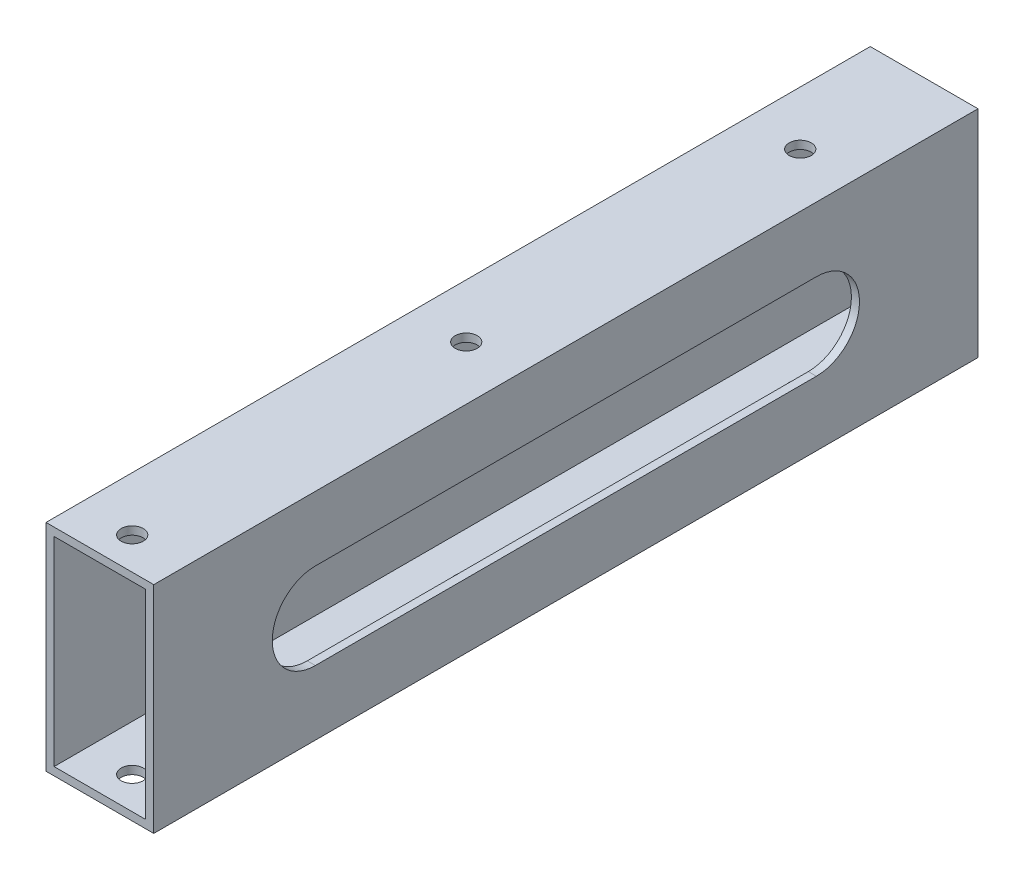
from build123d import *

# Parameters (mm, degrees)
SKETCH_1_W          = 20
SKETCH_1_H          = 40
SKETCH_1_W_2        = 17
SKETCH_1_H_2        = 37
EXTRUDE_1_DEPTH     = 170
SKETCH_2_R          = 2.05
CUT_EXTRUDE_1_DEPTH = 220
CUT_EXTRUDE_2_REACH = 174.337
SKETCH_3_W          = 17
SKETCH_3_H          = 40
CUT_EXTRUDE_3_DEPTH = 59


with BuildPart() as part:
    # Sketch 1 → Extrude 1 (new body)
    with BuildSketch(Plane.XY):
        Rectangle(SKETCH_1_W, SKETCH_1_H)
        Rectangle(SKETCH_1_W_2, SKETCH_1_H_2, mode=Mode.SUBTRACT)
    extrude(amount=EXTRUDE_1_DEPTH)

    # Sketch 2 → Cut-Extrude 1 (cut)
    with BuildSketch(Plane(origin=(0, 20, 0), x_dir=(1, 0, 0), z_dir=(0, 1, 0))):
        with Locations(Location((0, -147, 0), (0, 0, 270))):
            Circle(SKETCH_2_R)
        with Locations(Location((0, -23, 0), (0, 0, 270))):
            Circle(SKETCH_2_R)
        with Locations(Location((0, -85, 0), (0, 0, 270))):
            Circle(SKETCH_2_R)
    extrude(amount=-CUT_EXTRUDE_1_DEPTH, mode=Mode.SUBTRACT)

    # Cut-Extrude 2: up to this face of the body (flat: up to its plane)
    cut_extrude_2_end = Plane(part.part.faces().sort_by_distance((10, 0, 85))[0])
    # Sketch 3 → Cut-Extrude 2 (cut, up to the picked face)
    with BuildSketch(Plane.ZY.offset(10), mode=Mode.PRIVATE) as cut_extrude_2_sk1:
        with Locations((161.5, 0)):
            Rectangle(SKETCH_3_W, SKETCH_3_H)
    cut_extrude_2_tool1 = split(extrude(cut_extrude_2_sk1.sketch, amount=-CUT_EXTRUDE_2_REACH, mode=Mode.PRIVATE), bisect_by=cut_extrude_2_end, keep=Keep.BOTH, mode=Mode.PRIVATE)
    add(cut_extrude_2_tool1.solids().sort_by(Axis((-10, 0, 161.5), (1, 0, 0)))[0], mode=Mode.SUBTRACT)

    # Sketch 4 → Cut-Extrude 3 (cut)
    with BuildSketch(Plane(origin=(10, 0, 0), x_dir=(0, 0, -1), z_dir=(1, 0, 0))):
        with BuildLine():
            Line((-123, 8), (-30, 8))
            ThreePointArc((-30, 8), (-22, 0), (-30, -8))
            Line((-30, -8), (-123, -8))
            ThreePointArc((-123, -8), (-131, 0), (-123, 8))
        make_face()
    extrude(amount=-CUT_EXTRUDE_3_DEPTH, mode=Mode.SUBTRACT)


solid = part.part
